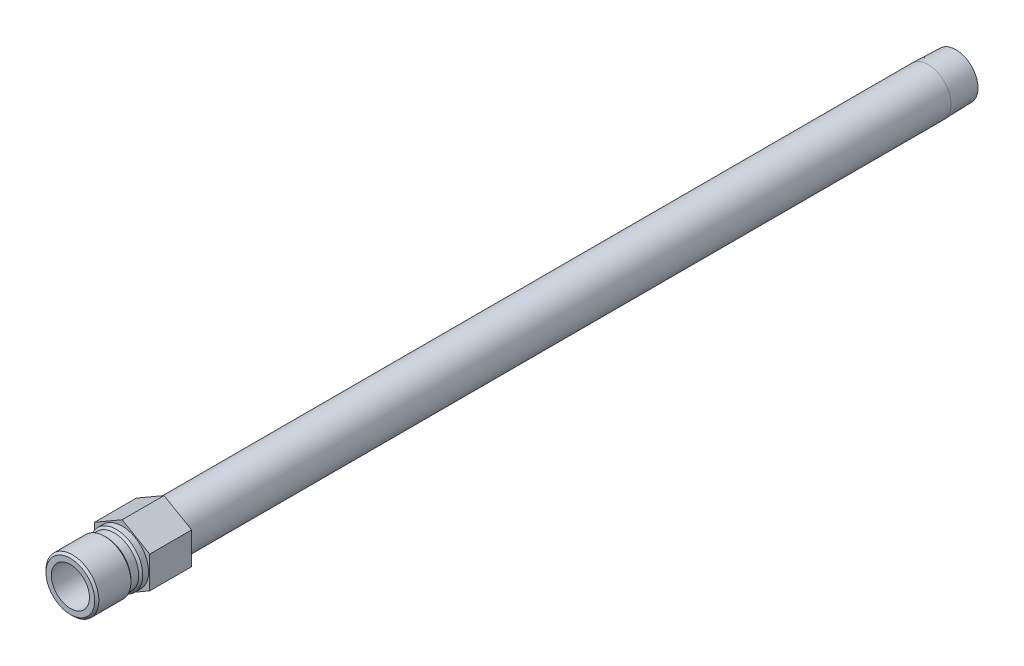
from build123d import *

# Parameters (mm, degrees)
SKETCH2_R           = 7.112
BOSS_EXTRUDE1_DEPTH = 15.621


with BuildPart() as part:
    # Sketch1 → Revolve1 (revolve)
    with BuildSketch(Plane(origin=(0, 0, 0), x_dir=(0, 0, -1), z_dir=(1, 0, 0))):
        Polygon((-19.304, 7.112), (-19.304, 9.0932), (-18.542, 9.8552), (-6.5786, 9.8552), (-5.8166, 9.0932), (-2.921, 9.0932), (-2.159, 9.8552), (0, 9.8552), (0, 8.5725), (300.5582, 8.5725), (310.896, 8.249445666), (310.896, 6.2611), (-1.071568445, 6.2611), (-1.524, 7.112), align=None)
    revolve(axis=Axis((0, 0, 0), (0, 0, 1)))

    # Sketch2 → Boss-Extrude1 (add)
    with BuildSketch(Plane.XY):
        Polygon((-10.287, 5.939202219), (-10.287, -5.939202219), (0, -11.878404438), (10.287, -5.939202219), (10.287, 5.939202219), (0, 11.878404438), align=None)
        with Locations(Location((0, 0, 0), (0, 0, 90))):
            Circle(SKETCH2_R, mode=Mode.SUBTRACT)
    extrude(amount=-BOSS_EXTRUDE1_DEPTH)


solid = part.part
